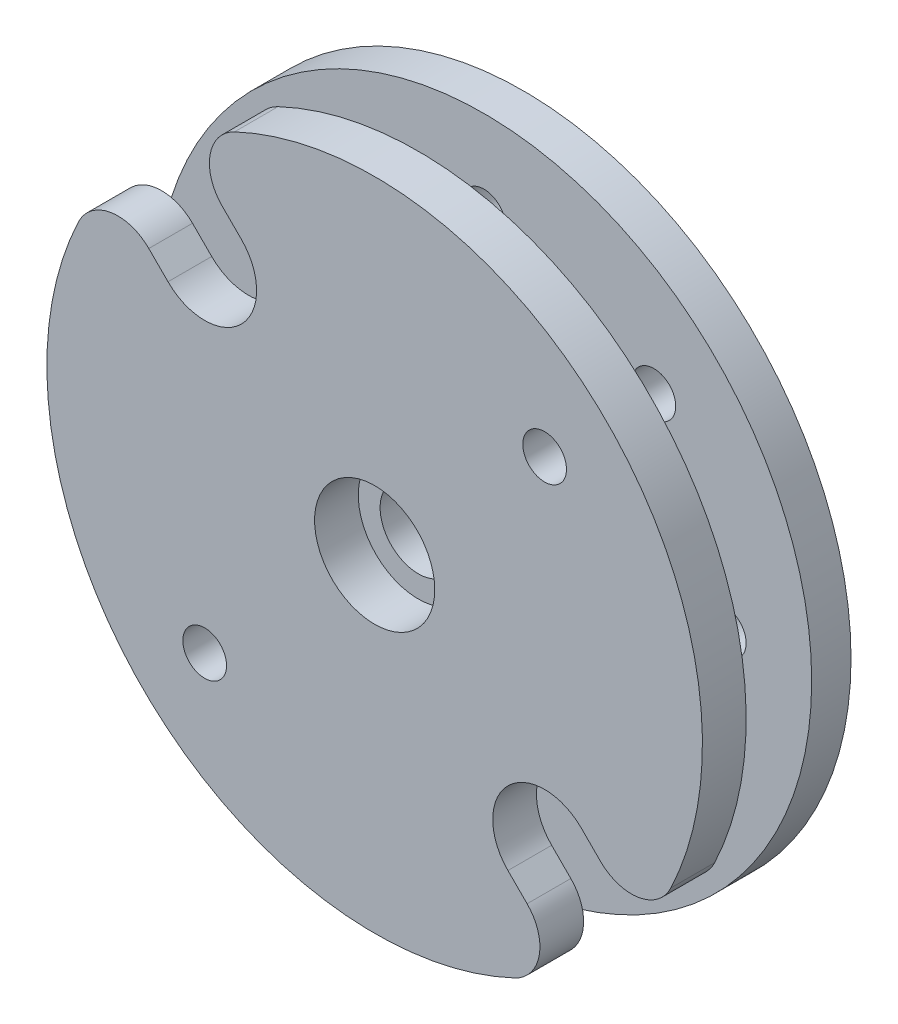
ISO-10303-21;
HEADER;
FILE_DESCRIPTION(('STEP AP214'),'2;1');
FILE_NAME('part.step','',(''),(''),'','','');
FILE_SCHEMA(('AUTOMOTIVE_DESIGN { 1 0 10303 214 1 1 1 1 }'));
ENDSEC;
DATA;
#1=APPLICATION_CONTEXT('core data for automotive mechanical design processes');
#2=APPLICATION_PROTOCOL_DEFINITION('international standard','automotive_design',2000,#1);
#3=PRODUCT_CONTEXT('',#1,'mechanical');
#4=PRODUCT('Part','Part','',(#3));
#5=PRODUCT_RELATED_PRODUCT_CATEGORY('part','',(#4));
#6=PRODUCT_DEFINITION_FORMATION('','',#4);
#7=PRODUCT_DEFINITION_CONTEXT('part definition',#1,'design');
#8=PRODUCT_DEFINITION('design','',#6,#7);
#9=PRODUCT_DEFINITION_SHAPE('','',#8);
#10=(LENGTH_UNIT() NAMED_UNIT(*) SI_UNIT(.MILLI.,.METRE.));
#11=(NAMED_UNIT(*) PLANE_ANGLE_UNIT() SI_UNIT($,.RADIAN.));
#12=(NAMED_UNIT(*) SI_UNIT($,.STERADIAN.) SOLID_ANGLE_UNIT());
#13=UNCERTAINTY_MEASURE_WITH_UNIT(LENGTH_MEASURE(1.E-05),#10,'distance_accuracy_value','');
#14=(GEOMETRIC_REPRESENTATION_CONTEXT(3) GLOBAL_UNCERTAINTY_ASSIGNED_CONTEXT((#13)) GLOBAL_UNIT_ASSIGNED_CONTEXT((#10,
#11,#12)) REPRESENTATION_CONTEXT('',''));
#15=CARTESIAN_POINT('',(0.,0.,0.));
#16=DIRECTION('',(0.,0.,1.));
#17=DIRECTION('',(1.,0.,0.));
#18=AXIS2_PLACEMENT_3D('',#15,#16,#17);
#19=CARTESIAN_POINT('',(0.,0.,-39.4264068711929));
#20=DIRECTION('',(0.,0.,1.));
#21=DIRECTION('',(1.,0.,0.));
#22=AXIS2_PLACEMENT_3D('',#19,#20,#21);
#23=CYLINDRICAL_SURFACE('',#22,15.);
#24=CARTESIAN_POINT('',(0.,0.,5.));
#25=DIRECTION('',(0.,0.,1.));
#26=DIRECTION('',(1.,0.,0.));
#27=AXIS2_PLACEMENT_3D('',#24,#25,#26);
#28=CIRCLE('',#27,15.);
#29=CARTESIAN_POINT('',(13.5574451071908,-6.41838625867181,5.));
#30=VERTEX_POINT('',#29);
#31=CARTESIAN_POINT('',(-6.41838625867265,13.5574451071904,5.));
#32=VERTEX_POINT('',#31);
#33=EDGE_CURVE('E222',#30,#32,#28,.T.);
#34=ORIENTED_EDGE('',*,*,#33,.F.);
#35=DIRECTION('',(0.,0.,1.));
#36=VECTOR('',#35,1.);
#37=CARTESIAN_POINT('',(13.5574451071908,-6.4183862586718,-39.4264068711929));
#38=LINE('',#37,#36);
#39=CARTESIAN_POINT('',(13.5574451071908,-6.41838625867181,3.));
#40=VERTEX_POINT('',#39);
#41=EDGE_CURVE('E345',#30,#40,#38,.F.);
#42=ORIENTED_EDGE('',*,*,#41,.T.);
#43=CARTESIAN_POINT('',(0.,0.,3.));
#44=DIRECTION('',(0.,0.,1.));
#45=DIRECTION('',(1.,0.,0.));
#46=AXIS2_PLACEMENT_3D('',#43,#44,#45);
#47=CIRCLE('',#46,15.);
#48=CARTESIAN_POINT('',(-6.41838625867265,13.5574451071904,3.));
#49=VERTEX_POINT('',#48);
#50=EDGE_CURVE('E226',#49,#40,#47,.F.);
#51=ORIENTED_EDGE('',*,*,#50,.F.);
#52=DIRECTION('',(0.,0.,1.));
#53=VECTOR('',#52,1.);
#54=CARTESIAN_POINT('',(-6.41838625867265,13.5574451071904,-39.4264068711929));
#55=LINE('',#54,#53);
#56=EDGE_CURVE('E341',#49,#32,#55,.T.);
#57=ORIENTED_EDGE('',*,*,#56,.T.);
#58=EDGE_LOOP('',(#34,#42,#51,#57));
#59=FACE_BOUND('',#58,.T.);
#60=ADVANCED_FACE('F38',(#59),#23,.T.);
#61=CARTESIAN_POINT('',(0.,0.,0.));
#62=DIRECTION('',(0.,0.,1.));
#63=DIRECTION('',(1.,0.,0.));
#64=AXIS2_PLACEMENT_3D('',#61,#62,#63);
#65=PLANE('',#64);
#66=CARTESIAN_POINT('',(0.,0.,0.));
#67=DIRECTION('',(0.,0.,1.));
#68=DIRECTION('',(1.,0.,0.));
#69=AXIS2_PLACEMENT_3D('',#66,#67,#68);
#70=CIRCLE('',#69,7.);
#71=CARTESIAN_POINT('',(7.,0.,0.));
#72=VERTEX_POINT('',#71);
#73=EDGE_CURVE('E11',#72,#72,#70,.F.);
#74=ORIENTED_EDGE('',*,*,#73,.T.);
#75=EDGE_LOOP('',(#74));
#76=FACE_BOUND('',#75,.T.);
#77=CARTESIAN_POINT('',(-7.77817459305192,7.77817459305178,0.));
#78=DIRECTION('',(0.,0.,1.));
#79=DIRECTION('',(1.,0.,0.));
#80=AXIS2_PLACEMENT_3D('',#77,#78,#79);
#81=CIRCLE('',#80,2.375);
#82=CARTESIAN_POINT('',(-5.40317459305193,7.77817459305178,0.));
#83=VERTEX_POINT('',#82);
#84=EDGE_CURVE('E235',#83,#83,#81,.T.);
#85=ORIENTED_EDGE('',*,*,#84,.F.);
#86=EDGE_LOOP('',(#85));
#87=FACE_BOUND('',#86,.T.);
#88=CARTESIAN_POINT('',(7.7781745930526,-7.77817459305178,0.));
#89=DIRECTION('',(0.,0.,1.));
#90=DIRECTION('',(1.,0.,0.));
#91=AXIS2_PLACEMENT_3D('',#88,#89,#90);
#92=CIRCLE('',#91,2.375);
#93=CARTESIAN_POINT('',(10.1531745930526,-7.77817459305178,0.));
#94=VERTEX_POINT('',#93);
#95=EDGE_CURVE('E234',#94,#94,#92,.T.);
#96=ORIENTED_EDGE('',*,*,#95,.F.);
#97=EDGE_LOOP('',(#96));
#98=FACE_BOUND('',#97,.T.);
#99=CARTESIAN_POINT('',(0.,0.,0.));
#100=DIRECTION('',(0.,0.,1.));
#101=DIRECTION('',(1.,0.,0.));
#102=AXIS2_PLACEMENT_3D('',#99,#100,#101);
#103=CIRCLE('',#102,15.);
#104=CARTESIAN_POINT('',(15.,0.,0.));
#105=VERTEX_POINT('',#104);
#106=EDGE_CURVE('E314',#105,#105,#103,.T.);
#107=ORIENTED_EDGE('',*,*,#106,.T.);
#108=EDGE_LOOP('',(#107));
#109=FACE_BOUND('',#108,.T.);
#110=CARTESIAN_POINT('',(0.,11.,0.));
#111=DIRECTION('',(0.,0.,1.));
#112=DIRECTION('',(1.,0.,0.));
#113=AXIS2_PLACEMENT_3D('',#110,#111,#112);
#114=CIRCLE('',#113,1.);
#115=CARTESIAN_POINT('',(1.,11.,0.));
#116=VERTEX_POINT('',#115);
#117=EDGE_CURVE('E299',#116,#116,#114,.T.);
#118=ORIENTED_EDGE('',*,*,#117,.F.);
#119=EDGE_LOOP('',(#118));
#120=FACE_BOUND('',#119,.T.);
#121=CARTESIAN_POINT('',(7.77817459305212,7.77817459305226,0.));
#122=DIRECTION('',(0.,0.,1.));
#123=DIRECTION('',(1.,0.,0.));
#124=AXIS2_PLACEMENT_3D('',#121,#122,#123);
#125=CIRCLE('',#124,1.);
#126=CARTESIAN_POINT('',(8.77817459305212,7.77817459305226,0.));
#127=VERTEX_POINT('',#126);
#128=EDGE_CURVE('E291',#127,#127,#125,.T.);
#129=ORIENTED_EDGE('',*,*,#128,.F.);
#130=EDGE_LOOP('',(#129));
#131=FACE_BOUND('',#130,.T.);
#132=CARTESIAN_POINT('',(11.0000000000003,3.40264492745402E-13,0.));
#133=DIRECTION('',(0.,0.,1.));
#134=DIRECTION('',(1.,0.,0.));
#135=AXIS2_PLACEMENT_3D('',#132,#133,#134);
#136=CIRCLE('',#135,1.);
#137=CARTESIAN_POINT('',(12.0000000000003,3.40264492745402E-13,0.));
#138=VERTEX_POINT('',#137);
#139=EDGE_CURVE('E283',#138,#138,#136,.T.);
#140=ORIENTED_EDGE('',*,*,#139,.F.);
#141=EDGE_LOOP('',(#140));
#142=FACE_BOUND('',#141,.T.);
#143=CARTESIAN_POINT('',(6.80528985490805E-13,-11.,0.));
#144=DIRECTION('',(0.,0.,1.));
#145=DIRECTION('',(1.,0.,0.));
#146=AXIS2_PLACEMENT_3D('',#143,#144,#145);
#147=CIRCLE('',#146,1.);
#148=CARTESIAN_POINT('',(1.00000000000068,-11.,0.));
#149=VERTEX_POINT('',#148);
#150=EDGE_CURVE('E275',#149,#149,#147,.T.);
#151=ORIENTED_EDGE('',*,*,#150,.F.);
#152=EDGE_LOOP('',(#151));
#153=FACE_BOUND('',#152,.T.);
#154=CARTESIAN_POINT('',(-7.77817459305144,-7.77817459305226,0.));
#155=DIRECTION('',(0.,0.,1.));
#156=DIRECTION('',(1.,0.,0.));
#157=AXIS2_PLACEMENT_3D('',#154,#155,#156);
#158=CIRCLE('',#157,1.);
#159=CARTESIAN_POINT('',(-6.77817459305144,-7.77817459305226,0.));
#160=VERTEX_POINT('',#159);
#161=EDGE_CURVE('E267',#160,#160,#158,.T.);
#162=ORIENTED_EDGE('',*,*,#161,.F.);
#163=EDGE_LOOP('',(#162));
#164=FACE_BOUND('',#163,.T.);
#165=CARTESIAN_POINT('',(-10.9999999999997,-3.41611604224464E-13,0.));
#166=DIRECTION('',(0.,0.,1.));
#167=DIRECTION('',(1.,0.,0.));
#168=AXIS2_PLACEMENT_3D('',#165,#166,#167);
#169=CIRCLE('',#168,1.);
#170=CARTESIAN_POINT('',(-9.99999999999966,-3.41611604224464E-13,0.));
#171=VERTEX_POINT('',#170);
#172=EDGE_CURVE('E262',#171,#171,#169,.T.);
#173=ORIENTED_EDGE('',*,*,#172,.F.);
#174=EDGE_LOOP('',(#173));
#175=FACE_BOUND('',#174,.T.);
#176=ADVANCED_FACE('F464',(#76,#87,#98,#109,#120,#131,#142,#153,#164,#175),#65,.T.);
#177=CARTESIAN_POINT('',(0.,0.,-1.8));
#178=DIRECTION('',(0.,0.,1.));
#179=DIRECTION('',(1.,0.,0.));
#180=AXIS2_PLACEMENT_3D('',#177,#178,#179);
#181=CYLINDRICAL_SURFACE('',#180,15.);
#182=CARTESIAN_POINT('',(0.,0.,-1.8));
#183=DIRECTION('',(0.,0.,1.));
#184=DIRECTION('',(1.,0.,0.));
#185=AXIS2_PLACEMENT_3D('',#182,#183,#184);
#186=CIRCLE('',#185,15.);
#187=CARTESIAN_POINT('',(15.,0.,-1.8));
#188=VERTEX_POINT('',#187);
#189=EDGE_CURVE('E315',#188,#188,#186,.T.);
#190=ORIENTED_EDGE('',*,*,#189,.T.);
#191=EDGE_LOOP('',(#190));
#192=FACE_BOUND('',#191,.T.);
#193=ORIENTED_EDGE('',*,*,#106,.F.);
#194=EDGE_LOOP('',(#193));
#195=FACE_BOUND('',#194,.T.);
#196=ADVANCED_FACE('F469',(#192,#195),#181,.T.);
#197=CARTESIAN_POINT('',(0.,0.,-1.8));
#198=DIRECTION('',(0.,0.,1.));
#199=DIRECTION('',(1.,0.,0.));
#200=AXIS2_PLACEMENT_3D('',#197,#198,#199);
#201=PLANE('',#200);
#202=CARTESIAN_POINT('',(-7.77817459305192,7.77817459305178,-1.8));
#203=DIRECTION('',(0.,0.,1.));
#204=DIRECTION('',(1.,0.,0.));
#205=AXIS2_PLACEMENT_3D('',#202,#203,#204);
#206=CIRCLE('',#205,2.375);
#207=CARTESIAN_POINT('',(-5.40317459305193,7.77817459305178,-1.8));
#208=VERTEX_POINT('',#207);
#209=EDGE_CURVE('E230',#208,#208,#206,.T.);
#210=ORIENTED_EDGE('',*,*,#209,.T.);
#211=EDGE_LOOP('',(#210));
#212=FACE_BOUND('',#211,.T.);
#213=CARTESIAN_POINT('',(7.7781745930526,-7.77817459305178,-1.8));
#214=DIRECTION('',(0.,0.,1.));
#215=DIRECTION('',(1.,0.,0.));
#216=AXIS2_PLACEMENT_3D('',#213,#214,#215);
#217=CIRCLE('',#216,2.375);
#218=CARTESIAN_POINT('',(10.1531745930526,-7.77817459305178,-1.8));
#219=VERTEX_POINT('',#218);
#220=EDGE_CURVE('E239',#219,#219,#217,.T.);
#221=ORIENTED_EDGE('',*,*,#220,.T.);
#222=EDGE_LOOP('',(#221));
#223=FACE_BOUND('',#222,.T.);
#224=CARTESIAN_POINT('',(-10.9999999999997,-3.41611604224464E-13,-1.8));
#225=DIRECTION('',(0.,0.,1.));
#226=DIRECTION('',(1.,0.,0.));
#227=AXIS2_PLACEMENT_3D('',#224,#225,#226);
#228=CIRCLE('',#227,1.);
#229=CARTESIAN_POINT('',(-9.99999999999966,-3.41611604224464E-13,-1.8));
#230=VERTEX_POINT('',#229);
#231=EDGE_CURVE('E263',#230,#230,#228,.T.);
#232=ORIENTED_EDGE('',*,*,#231,.T.);
#233=EDGE_LOOP('',(#232));
#234=FACE_BOUND('',#233,.T.);
#235=CARTESIAN_POINT('',(-7.77817459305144,-7.77817459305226,-1.8));
#236=DIRECTION('',(0.,0.,1.));
#237=DIRECTION('',(1.,0.,0.));
#238=AXIS2_PLACEMENT_3D('',#235,#236,#237);
#239=CIRCLE('',#238,1.);
#240=CARTESIAN_POINT('',(-6.77817459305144,-7.77817459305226,-1.8));
#241=VERTEX_POINT('',#240);
#242=EDGE_CURVE('E271',#241,#241,#239,.T.);
#243=ORIENTED_EDGE('',*,*,#242,.T.);
#244=EDGE_LOOP('',(#243));
#245=FACE_BOUND('',#244,.T.);
#246=CARTESIAN_POINT('',(6.80528985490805E-13,-11.,-1.8));
#247=DIRECTION('',(0.,0.,1.));
#248=DIRECTION('',(1.,0.,0.));
#249=AXIS2_PLACEMENT_3D('',#246,#247,#248);
#250=CIRCLE('',#249,1.);
#251=CARTESIAN_POINT('',(1.00000000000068,-11.,-1.8));
#252=VERTEX_POINT('',#251);
#253=EDGE_CURVE('E279',#252,#252,#250,.T.);
#254=ORIENTED_EDGE('',*,*,#253,.T.);
#255=EDGE_LOOP('',(#254));
#256=FACE_BOUND('',#255,.T.);
#257=CARTESIAN_POINT('',(11.0000000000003,3.40264492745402E-13,-1.8));
#258=DIRECTION('',(0.,0.,1.));
#259=DIRECTION('',(1.,0.,0.));
#260=AXIS2_PLACEMENT_3D('',#257,#258,#259);
#261=CIRCLE('',#260,1.);
#262=CARTESIAN_POINT('',(12.0000000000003,3.40264492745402E-13,-1.8));
#263=VERTEX_POINT('',#262);
#264=EDGE_CURVE('E287',#263,#263,#261,.T.);
#265=ORIENTED_EDGE('',*,*,#264,.T.);
#266=EDGE_LOOP('',(#265));
#267=FACE_BOUND('',#266,.T.);
#268=CARTESIAN_POINT('',(7.77817459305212,7.77817459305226,-1.8));
#269=DIRECTION('',(0.,0.,1.));
#270=DIRECTION('',(1.,0.,0.));
#271=AXIS2_PLACEMENT_3D('',#268,#269,#270);
#272=CIRCLE('',#271,1.);
#273=CARTESIAN_POINT('',(8.77817459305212,7.77817459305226,-1.8));
#274=VERTEX_POINT('',#273);
#275=EDGE_CURVE('E295',#274,#274,#272,.T.);
#276=ORIENTED_EDGE('',*,*,#275,.T.);
#277=EDGE_LOOP('',(#276));
#278=FACE_BOUND('',#277,.T.);
#279=CARTESIAN_POINT('',(0.,11.,-1.8));
#280=DIRECTION('',(0.,0.,1.));
#281=DIRECTION('',(1.,0.,0.));
#282=AXIS2_PLACEMENT_3D('',#279,#280,#281);
#283=CIRCLE('',#282,1.);
#284=CARTESIAN_POINT('',(1.,11.,-1.8));
#285=VERTEX_POINT('',#284);
#286=EDGE_CURVE('E303',#285,#285,#283,.T.);
#287=ORIENTED_EDGE('',*,*,#286,.T.);
#288=EDGE_LOOP('',(#287));
#289=FACE_BOUND('',#288,.T.);
#290=CARTESIAN_POINT('',(0.,0.,-1.8));
#291=DIRECTION('',(0.,0.,1.));
#292=DIRECTION('',(1.,0.,0.));
#293=AXIS2_PLACEMENT_3D('',#290,#291,#292);
#294=CIRCLE('',#293,5.25);
#295=CARTESIAN_POINT('',(5.25,0.,-1.8));
#296=VERTEX_POINT('',#295);
#297=EDGE_CURVE('E307',#296,#296,#294,.T.);
#298=ORIENTED_EDGE('',*,*,#297,.T.);
#299=EDGE_LOOP('',(#298));
#300=FACE_BOUND('',#299,.T.);
#301=ORIENTED_EDGE('',*,*,#189,.F.);
#302=EDGE_LOOP('',(#301));
#303=FACE_BOUND('',#302,.T.);
#304=ADVANCED_FACE('F537',(#212,#223,#234,#245,#256,#267,#278,#289,#300,#303),#201,.F.);
#305=CARTESIAN_POINT('',(0.,0.,-1.8));
#306=DIRECTION('',(0.,0.,1.));
#307=DIRECTION('',(1.,0.,0.));
#308=AXIS2_PLACEMENT_3D('',#305,#306,#307);
#309=CYLINDRICAL_SURFACE('',#308,5.25);
#310=ORIENTED_EDGE('',*,*,#297,.F.);
#311=EDGE_LOOP('',(#310));
#312=FACE_BOUND('',#311,.T.);
#313=CARTESIAN_POINT('',(0.,0.,0.));
#314=DIRECTION('',(0.,0.,1.));
#315=DIRECTION('',(1.,0.,0.));
#316=AXIS2_PLACEMENT_3D('',#313,#314,#315);
#317=CIRCLE('',#316,5.25);
#318=CARTESIAN_POINT('',(5.25,0.,0.));
#319=VERTEX_POINT('',#318);
#320=EDGE_CURVE('E255',#319,#319,#317,.F.);
#321=ORIENTED_EDGE('',*,*,#320,.F.);
#322=EDGE_LOOP('',(#321));
#323=FACE_BOUND('',#322,.T.);
#324=ADVANCED_FACE('F533',(#312,#323),#309,.F.);
#325=CARTESIAN_POINT('',(0.,11.,-1.8));
#326=DIRECTION('',(0.,0.,1.));
#327=DIRECTION('',(1.,0.,0.));
#328=AXIS2_PLACEMENT_3D('',#325,#326,#327);
#329=CYLINDRICAL_SURFACE('',#328,1.);
#330=ORIENTED_EDGE('',*,*,#286,.F.);
#331=EDGE_LOOP('',(#330));
#332=FACE_BOUND('',#331,.T.);
#333=ORIENTED_EDGE('',*,*,#117,.T.);
#334=EDGE_LOOP('',(#333));
#335=FACE_BOUND('',#334,.T.);
#336=ADVANCED_FACE('F529',(#332,#335),#329,.F.);
#337=CARTESIAN_POINT('',(7.77817459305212,7.77817459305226,-1.8));
#338=DIRECTION('',(0.,0.,1.));
#339=DIRECTION('',(1.,0.,0.));
#340=AXIS2_PLACEMENT_3D('',#337,#338,#339);
#341=CYLINDRICAL_SURFACE('',#340,1.);
#342=ORIENTED_EDGE('',*,*,#275,.F.);
#343=EDGE_LOOP('',(#342));
#344=FACE_BOUND('',#343,.T.);
#345=ORIENTED_EDGE('',*,*,#128,.T.);
#346=EDGE_LOOP('',(#345));
#347=FACE_BOUND('',#346,.T.);
#348=ADVANCED_FACE('F525',(#344,#347),#341,.F.);
#349=CARTESIAN_POINT('',(11.0000000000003,3.40264492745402E-13,-1.8));
#350=DIRECTION('',(0.,0.,1.));
#351=DIRECTION('',(1.,0.,0.));
#352=AXIS2_PLACEMENT_3D('',#349,#350,#351);
#353=CYLINDRICAL_SURFACE('',#352,1.);
#354=ORIENTED_EDGE('',*,*,#264,.F.);
#355=EDGE_LOOP('',(#354));
#356=FACE_BOUND('',#355,.T.);
#357=ORIENTED_EDGE('',*,*,#139,.T.);
#358=EDGE_LOOP('',(#357));
#359=FACE_BOUND('',#358,.T.);
#360=ADVANCED_FACE('F521',(#356,#359),#353,.F.);
#361=CARTESIAN_POINT('',(6.80528985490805E-13,-11.,-1.8));
#362=DIRECTION('',(0.,0.,1.));
#363=DIRECTION('',(1.,0.,0.));
#364=AXIS2_PLACEMENT_3D('',#361,#362,#363);
#365=CYLINDRICAL_SURFACE('',#364,1.);
#366=ORIENTED_EDGE('',*,*,#253,.F.);
#367=EDGE_LOOP('',(#366));
#368=FACE_BOUND('',#367,.T.);
#369=ORIENTED_EDGE('',*,*,#150,.T.);
#370=EDGE_LOOP('',(#369));
#371=FACE_BOUND('',#370,.T.);
#372=ADVANCED_FACE('F517',(#368,#371),#365,.F.);
#373=CARTESIAN_POINT('',(-7.77817459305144,-7.77817459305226,-1.8));
#374=DIRECTION('',(0.,0.,1.));
#375=DIRECTION('',(1.,0.,0.));
#376=AXIS2_PLACEMENT_3D('',#373,#374,#375);
#377=CYLINDRICAL_SURFACE('',#376,1.);
#378=ORIENTED_EDGE('',*,*,#242,.F.);
#379=EDGE_LOOP('',(#378));
#380=FACE_BOUND('',#379,.T.);
#381=ORIENTED_EDGE('',*,*,#161,.T.);
#382=EDGE_LOOP('',(#381));
#383=FACE_BOUND('',#382,.T.);
#384=ADVANCED_FACE('F513',(#380,#383),#377,.F.);
#385=CARTESIAN_POINT('',(-10.9999999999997,-3.41611604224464E-13,-1.8));
#386=DIRECTION('',(0.,0.,1.));
#387=DIRECTION('',(1.,0.,0.));
#388=AXIS2_PLACEMENT_3D('',#385,#386,#387);
#389=CYLINDRICAL_SURFACE('',#388,1.);
#390=ORIENTED_EDGE('',*,*,#231,.F.);
#391=EDGE_LOOP('',(#390));
#392=FACE_BOUND('',#391,.T.);
#393=ORIENTED_EDGE('',*,*,#172,.T.);
#394=EDGE_LOOP('',(#393));
#395=FACE_BOUND('',#394,.T.);
#396=ADVANCED_FACE('F507',(#392,#395),#389,.F.);
#397=CARTESIAN_POINT('',(0.,0.,0.));
#398=DIRECTION('',(0.,0.,1.));
#399=DIRECTION('',(1.,0.,0.));
#400=AXIS2_PLACEMENT_3D('',#397,#398,#399);
#401=PLANE('',#400);
#402=CARTESIAN_POINT('',(0.,0.,0.));
#403=DIRECTION('',(0.,0.,1.));
#404=DIRECTION('',(1.,0.,0.));
#405=AXIS2_PLACEMENT_3D('',#402,#403,#404);
#406=CIRCLE('',#405,1.75);
#407=CARTESIAN_POINT('',(1.75,0.,0.));
#408=VERTEX_POINT('',#407);
#409=EDGE_CURVE('E250',#408,#408,#406,.T.);
#410=ORIENTED_EDGE('',*,*,#409,.T.);
#411=EDGE_LOOP('',(#410));
#412=FACE_BOUND('',#411,.T.);
#413=ORIENTED_EDGE('',*,*,#320,.T.);
#414=EDGE_LOOP('',(#413));
#415=FACE_BOUND('',#414,.T.);
#416=ADVANCED_FACE('F503',(#412,#415),#401,.F.);
#417=CARTESIAN_POINT('',(0.,0.,3.));
#418=DIRECTION('',(0.,0.,1.));
#419=DIRECTION('',(1.,0.,0.));
#420=AXIS2_PLACEMENT_3D('',#417,#418,#419);
#421=PLANE('',#420);
#422=CARTESIAN_POINT('',(0.,0.,3.));
#423=DIRECTION('',(0.,0.,1.));
#424=DIRECTION('',(1.,0.,0.));
#425=AXIS2_PLACEMENT_3D('',#422,#423,#424);
#426=CIRCLE('',#425,2.75);
#427=CARTESIAN_POINT('',(2.75,0.,3.));
#428=VERTEX_POINT('',#427);
#429=EDGE_CURVE('E319',#428,#428,#426,.F.);
#430=ORIENTED_EDGE('',*,*,#429,.F.);
#431=EDGE_LOOP('',(#430));
#432=FACE_BOUND('',#431,.T.);
#433=CARTESIAN_POINT('',(0.,0.,3.));
#434=DIRECTION('',(0.,0.,1.));
#435=DIRECTION('',(1.,0.,0.));
#436=AXIS2_PLACEMENT_3D('',#433,#434,#435);
#437=CIRCLE('',#436,1.75);
#438=CARTESIAN_POINT('',(1.75,0.,3.));
#439=VERTEX_POINT('',#438);
#440=EDGE_CURVE('E251',#439,#439,#437,.T.);
#441=ORIENTED_EDGE('',*,*,#440,.F.);
#442=EDGE_LOOP('',(#441));
#443=FACE_BOUND('',#442,.T.);
#444=ADVANCED_FACE('F500',(#432,#443),#421,.T.);
#445=CARTESIAN_POINT('',(0.,0.,3.));
#446=DIRECTION('',(0.,0.,-1.));
#447=DIRECTION('',(-1.,0.,0.));
#448=AXIS2_PLACEMENT_3D('',#445,#446,#447);
#449=CYLINDRICAL_SURFACE('',#448,6.25);
#450=CARTESIAN_POINT('',(0.,0.,2.25));
#451=DIRECTION('',(0.,0.,1.));
#452=DIRECTION('',(1.,0.,0.));
#453=AXIS2_PLACEMENT_3D('',#450,#451,#452);
#454=CIRCLE('',#453,6.25);
#455=CARTESIAN_POINT('',(6.25,0.,2.25));
#456=VERTEX_POINT('',#455);
#457=EDGE_CURVE('E47',#456,#456,#454,.F.);
#458=ORIENTED_EDGE('',*,*,#457,.T.);
#459=EDGE_LOOP('',(#458));
#460=FACE_BOUND('',#459,.T.);
#461=CARTESIAN_POINT('',(0.,0.,0.750000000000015));
#462=DIRECTION('',(0.,0.,1.));
#463=DIRECTION('',(1.,0.,0.));
#464=AXIS2_PLACEMENT_3D('',#461,#462,#463);
#465=CIRCLE('',#464,6.25);
#466=CARTESIAN_POINT('',(6.25,0.,0.750000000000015));
#467=VERTEX_POINT('',#466);
#468=EDGE_CURVE('E378',#467,#467,#465,.T.);
#469=ORIENTED_EDGE('',*,*,#468,.T.);
#470=EDGE_LOOP('',(#469));
#471=FACE_BOUND('',#470,.T.);
#472=ADVANCED_FACE('F385',(#460,#471),#449,.T.);
#473=CARTESIAN_POINT('',(0.,0.,3.));
#474=DIRECTION('',(0.,0.,-1.));
#475=DIRECTION('',(-1.,0.,0.));
#476=AXIS2_PLACEMENT_3D('',#473,#474,#475);
#477=CYLINDRICAL_SURFACE('',#476,1.75);
#478=ORIENTED_EDGE('',*,*,#440,.T.);
#479=EDGE_LOOP('',(#478));
#480=FACE_BOUND('',#479,.T.);
#481=ORIENTED_EDGE('',*,*,#409,.F.);
#482=EDGE_LOOP('',(#481));
#483=FACE_BOUND('',#482,.T.);
#484=ADVANCED_FACE('F397',(#480,#483),#477,.F.);
#485=CARTESIAN_POINT('',(0.,0.,3.));
#486=DIRECTION('',(0.,0.,1.));
#487=DIRECTION('',(1.,0.,0.));
#488=AXIS2_PLACEMENT_3D('',#485,#486,#487);
#489=PLANE('',#488);
#490=CARTESIAN_POINT('',(0.,0.,3.));
#491=DIRECTION('',(0.,0.,1.));
#492=DIRECTION('',(1.,0.,0.));
#493=AXIS2_PLACEMENT_3D('',#490,#491,#492);
#494=CIRCLE('',#493,7.00000000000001);
#495=CARTESIAN_POINT('',(7.00000000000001,0.,3.));
#496=VERTEX_POINT('',#495);
#497=EDGE_CURVE('E374',#496,#496,#494,.T.);
#498=ORIENTED_EDGE('',*,*,#497,.T.);
#499=EDGE_LOOP('',(#498));
#500=FACE_BOUND('',#499,.T.);
#501=CARTESIAN_POINT('',(-7.77817459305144,-7.77817459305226,3.));
#502=DIRECTION('',(0.,0.,1.));
#503=DIRECTION('',(1.,0.,0.));
#504=AXIS2_PLACEMENT_3D('',#501,#502,#503);
#505=CIRCLE('',#504,1.);
#506=CARTESIAN_POINT('',(-6.77817459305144,-7.77817459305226,3.));
#507=VERTEX_POINT('',#506);
#508=EDGE_CURVE('E402',#507,#507,#505,.T.);
#509=ORIENTED_EDGE('',*,*,#508,.T.);
#510=EDGE_LOOP('',(#509));
#511=FACE_BOUND('',#510,.T.);
#512=CARTESIAN_POINT('',(7.77817459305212,7.77817459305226,3.));
#513=DIRECTION('',(0.,0.,1.));
#514=DIRECTION('',(1.,0.,0.));
#515=AXIS2_PLACEMENT_3D('',#512,#513,#514);
#516=CIRCLE('',#515,1.);
#517=CARTESIAN_POINT('',(8.77817459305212,7.77817459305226,3.));
#518=VERTEX_POINT('',#517);
#519=EDGE_CURVE('E177',#518,#518,#516,.T.);
#520=ORIENTED_EDGE('',*,*,#519,.T.);
#521=EDGE_LOOP('',(#520));
#522=FACE_BOUND('',#521,.T.);
#523=ORIENTED_EDGE('',*,*,#50,.T.);
#524=CARTESIAN_POINT('',(11.7497857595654,-5.56260142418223,3.));
#525=DIRECTION('',(0.,0.,1.));
#526=DIRECTION('',(1.,0.,0.));
#527=AXIS2_PLACEMENT_3D('',#524,#525,#526);
#528=CIRCLE('',#527,2.);
#529=CARTESIAN_POINT('',(10.3355721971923,-6.97681498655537,3.));
#530=VERTEX_POINT('',#529);
#531=EDGE_CURVE('E356',#40,#530,#528,.F.);
#532=ORIENTED_EDGE('',*,*,#531,.T.);
#533=DIRECTION('',(0.707106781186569,-0.707106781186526,0.));
#534=VECTOR('',#533,1.);
#535=CARTESIAN_POINT('',(9.4575531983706,-6.09879598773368,3.));
#536=LINE('',#535,#534);
#537=CARTESIAN_POINT('',(9.4575531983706,-6.09879598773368,3.));
#538=VERTEX_POINT('',#537);
#539=EDGE_CURVE('E191',#538,#530,#536,.T.);
#540=ORIENTED_EDGE('',*,*,#539,.F.);
#541=CARTESIAN_POINT('',(7.7781745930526,-7.77817459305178,3.));
#542=DIRECTION('',(0.,0.,1.));
#543=DIRECTION('',(1.,0.,0.));
#544=AXIS2_PLACEMENT_3D('',#541,#542,#543);
#545=CIRCLE('',#544,2.375);
#546=CARTESIAN_POINT('',(6.0987959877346,-9.45755319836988,3.));
#547=VERTEX_POINT('',#546);
#548=EDGE_CURVE('E196',#547,#538,#545,.F.);
#549=ORIENTED_EDGE('',*,*,#548,.F.);
#550=DIRECTION('',(-0.70710678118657,0.707106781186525,0.));
#551=VECTOR('',#550,1.);
#552=CARTESIAN_POINT('',(6.0987959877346,-9.45755319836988,3.));
#553=LINE('',#552,#551);
#554=CARTESIAN_POINT('',(6.97681498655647,-10.3355721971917,3.));
#555=VERTEX_POINT('',#554);
#556=EDGE_CURVE('E162',#555,#547,#553,.T.);
#557=ORIENTED_EDGE('',*,*,#556,.F.);
#558=CARTESIAN_POINT('',(5.56260142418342,-11.7497857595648,3.));
#559=DIRECTION('',(0.,0.,1.));
#560=DIRECTION('',(1.,0.,0.));
#561=AXIS2_PLACEMENT_3D('',#558,#559,#560);
#562=CIRCLE('',#561,2.);
#563=CARTESIAN_POINT('',(6.41838625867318,-13.5574451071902,3.));
#564=VERTEX_POINT('',#563);
#565=EDGE_CURVE('E353',#555,#564,#562,.F.);
#566=ORIENTED_EDGE('',*,*,#565,.T.);
#567=CARTESIAN_POINT('',(-13.5574451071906,6.41838625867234,3.));
#568=VERTEX_POINT('',#567);
#569=EDGE_CURVE('E223',#564,#568,#47,.F.);
#570=ORIENTED_EDGE('',*,*,#569,.T.);
#571=CARTESIAN_POINT('',(-11.7497857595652,5.56260142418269,3.));
#572=DIRECTION('',(0.,0.,1.));
#573=DIRECTION('',(1.,0.,0.));
#574=AXIS2_PLACEMENT_3D('',#571,#572,#573);
#575=CIRCLE('',#574,2.);
#576=CARTESIAN_POINT('',(-10.3355721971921,6.97681498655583,3.));
#577=VERTEX_POINT('',#576);
#578=EDGE_CURVE('E68',#568,#577,#575,.F.);
#579=ORIENTED_EDGE('',*,*,#578,.T.);
#580=DIRECTION('',(-0.70710678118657,0.707106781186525,0.));
#581=VECTOR('',#580,1.);
#582=CARTESIAN_POINT('',(-9.45755319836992,6.09879598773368,3.));
#583=LINE('',#582,#581);
#584=CARTESIAN_POINT('',(-9.45755319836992,6.09879598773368,3.));
#585=VERTEX_POINT('',#584);
#586=EDGE_CURVE('E197',#585,#577,#583,.T.);
#587=ORIENTED_EDGE('',*,*,#586,.F.);
#588=CARTESIAN_POINT('',(-7.77817459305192,7.77817459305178,3.));
#589=DIRECTION('',(0.,0.,1.));
#590=DIRECTION('',(1.,0.,0.));
#591=AXIS2_PLACEMENT_3D('',#588,#589,#590);
#592=CIRCLE('',#591,2.375);
#593=CARTESIAN_POINT('',(-6.09879598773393,9.45755319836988,3.));
#594=VERTEX_POINT('',#593);
#595=EDGE_CURVE('E200',#594,#585,#592,.F.);
#596=ORIENTED_EDGE('',*,*,#595,.F.);
#597=DIRECTION('',(0.707106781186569,-0.707106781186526,0.));
#598=VECTOR('',#597,1.);
#599=CARTESIAN_POINT('',(-6.09879598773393,9.45755319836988,3.));
#600=LINE('',#599,#598);
#601=CARTESIAN_POINT('',(-6.97681498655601,10.3355721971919,3.));
#602=VERTEX_POINT('',#601);
#603=EDGE_CURVE('E204',#602,#594,#600,.T.);
#604=ORIENTED_EDGE('',*,*,#603,.F.);
#605=CARTESIAN_POINT('',(-5.56260142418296,11.7497857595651,3.));
#606=DIRECTION('',(0.,0.,1.));
#607=DIRECTION('',(1.,0.,0.));
#608=AXIS2_PLACEMENT_3D('',#605,#606,#607);
#609=CIRCLE('',#608,2.);
#610=EDGE_CURVE('E348',#602,#49,#609,.F.);
#611=ORIENTED_EDGE('',*,*,#610,.T.);
#612=EDGE_LOOP('',(#523,#532,#540,#549,#557,#566,#570,#579,#587,#596,#604,#611));
#613=FACE_BOUND('',#612,.T.);
#614=ADVANCED_FACE('F394',(#500,#511,#522,#613),#489,.F.);
#615=CARTESIAN_POINT('',(0.,0.,5.));
#616=DIRECTION('',(0.,0.,1.));
#617=DIRECTION('',(1.,0.,0.));
#618=AXIS2_PLACEMENT_3D('',#615,#616,#617);
#619=PLANE('',#618);
#620=CARTESIAN_POINT('',(-7.77817459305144,-7.77817459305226,5.));
#621=DIRECTION('',(0.,0.,-1.));
#622=DIRECTION('',(-1.,0.,0.));
#623=AXIS2_PLACEMENT_3D('',#620,#621,#622);
#624=CIRCLE('',#623,1.);
#625=CARTESIAN_POINT('',(-8.77817459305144,-7.77817459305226,5.));
#626=VERTEX_POINT('',#625);
#627=EDGE_CURVE('E797',#626,#626,#624,.T.);
#628=ORIENTED_EDGE('',*,*,#627,.T.);
#629=EDGE_LOOP('',(#628));
#630=FACE_BOUND('',#629,.T.);
#631=CARTESIAN_POINT('',(7.77817459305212,7.77817459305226,5.));
#632=DIRECTION('',(0.,0.,-1.));
#633=DIRECTION('',(-1.,0.,0.));
#634=AXIS2_PLACEMENT_3D('',#631,#632,#633);
#635=CIRCLE('',#634,1.);
#636=CARTESIAN_POINT('',(6.77817459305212,7.77817459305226,5.));
#637=VERTEX_POINT('',#636);
#638=EDGE_CURVE('E424',#637,#637,#635,.T.);
#639=ORIENTED_EDGE('',*,*,#638,.T.);
#640=EDGE_LOOP('',(#639));
#641=FACE_BOUND('',#640,.T.);
#642=DIRECTION('',(-0.707106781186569,0.707106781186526,0.));
#643=VECTOR('',#642,1.);
#644=CARTESIAN_POINT('',(9.4575531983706,-6.09879598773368,5.));
#645=LINE('',#644,#643);
#646=CARTESIAN_POINT('',(10.3355721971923,-6.97681498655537,5.));
#647=VERTEX_POINT('',#646);
#648=CARTESIAN_POINT('',(9.4575531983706,-6.09879598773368,5.));
#649=VERTEX_POINT('',#648);
#650=EDGE_CURVE('E167',#647,#649,#645,.T.);
#651=ORIENTED_EDGE('',*,*,#650,.F.);
#652=CARTESIAN_POINT('',(11.7497857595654,-5.56260142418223,5.));
#653=DIRECTION('',(0.,0.,1.));
#654=DIRECTION('',(1.,0.,0.));
#655=AXIS2_PLACEMENT_3D('',#652,#653,#654);
#656=CIRCLE('',#655,2.);
#657=EDGE_CURVE('E338',#647,#30,#656,.T.);
#658=ORIENTED_EDGE('',*,*,#657,.T.);
#659=ORIENTED_EDGE('',*,*,#33,.T.);
#660=CARTESIAN_POINT('',(-5.56260142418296,11.7497857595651,5.));
#661=DIRECTION('',(0.,0.,1.));
#662=DIRECTION('',(1.,0.,0.));
#663=AXIS2_PLACEMENT_3D('',#660,#661,#662);
#664=CIRCLE('',#663,2.);
#665=CARTESIAN_POINT('',(-6.97681498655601,10.3355721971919,5.));
#666=VERTEX_POINT('',#665);
#667=EDGE_CURVE('E330',#32,#666,#664,.T.);
#668=ORIENTED_EDGE('',*,*,#667,.T.);
#669=DIRECTION('',(-0.707106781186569,0.707106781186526,0.));
#670=VECTOR('',#669,1.);
#671=CARTESIAN_POINT('',(-6.09879598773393,9.45755319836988,5.));
#672=LINE('',#671,#670);
#673=CARTESIAN_POINT('',(-6.09879598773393,9.45755319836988,5.));
#674=VERTEX_POINT('',#673);
#675=EDGE_CURVE('E208',#674,#666,#672,.T.);
#676=ORIENTED_EDGE('',*,*,#675,.F.);
#677=CARTESIAN_POINT('',(-7.77817459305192,7.77817459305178,5.));
#678=DIRECTION('',(0.,0.,1.));
#679=DIRECTION('',(-1.,0.,0.));
#680=AXIS2_PLACEMENT_3D('',#677,#678,#679);
#681=CIRCLE('',#680,2.375);
#682=CARTESIAN_POINT('',(-9.45755319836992,6.09879598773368,5.));
#683=VERTEX_POINT('',#682);
#684=EDGE_CURVE('E195',#683,#674,#681,.T.);
#685=ORIENTED_EDGE('',*,*,#684,.F.);
#686=DIRECTION('',(0.70710678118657,-0.707106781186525,0.));
#687=VECTOR('',#686,1.);
#688=CARTESIAN_POINT('',(-9.45755319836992,6.09879598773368,5.));
#689=LINE('',#688,#687);
#690=CARTESIAN_POINT('',(-10.3355721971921,6.97681498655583,5.));
#691=VERTEX_POINT('',#690);
#692=EDGE_CURVE('E211',#691,#683,#689,.T.);
#693=ORIENTED_EDGE('',*,*,#692,.F.);
#694=CARTESIAN_POINT('',(-11.7497857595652,5.56260142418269,5.));
#695=DIRECTION('',(0.,0.,1.));
#696=DIRECTION('',(1.,0.,0.));
#697=AXIS2_PLACEMENT_3D('',#694,#695,#696);
#698=CIRCLE('',#697,2.);
#699=CARTESIAN_POINT('',(-13.5574451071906,6.41838625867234,5.));
#700=VERTEX_POINT('',#699);
#701=EDGE_CURVE('E333',#691,#700,#698,.T.);
#702=ORIENTED_EDGE('',*,*,#701,.T.);
#703=CARTESIAN_POINT('',(6.41838625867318,-13.5574451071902,5.));
#704=VERTEX_POINT('',#703);
#705=EDGE_CURVE('E227',#700,#704,#28,.T.);
#706=ORIENTED_EDGE('',*,*,#705,.T.);
#707=CARTESIAN_POINT('',(5.56260142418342,-11.7497857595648,5.));
#708=DIRECTION('',(0.,0.,1.));
#709=DIRECTION('',(1.,0.,0.));
#710=AXIS2_PLACEMENT_3D('',#707,#708,#709);
#711=CIRCLE('',#710,2.);
#712=CARTESIAN_POINT('',(6.97681498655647,-10.3355721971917,5.));
#713=VERTEX_POINT('',#712);
#714=EDGE_CURVE('E182',#704,#713,#711,.T.);
#715=ORIENTED_EDGE('',*,*,#714,.T.);
#716=DIRECTION('',(0.70710678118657,-0.707106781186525,0.));
#717=VECTOR('',#716,1.);
#718=CARTESIAN_POINT('',(6.0987959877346,-9.45755319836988,5.));
#719=LINE('',#718,#717);
#720=CARTESIAN_POINT('',(6.0987959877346,-9.45755319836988,5.));
#721=VERTEX_POINT('',#720);
#722=EDGE_CURVE('E159',#721,#713,#719,.T.);
#723=ORIENTED_EDGE('',*,*,#722,.F.);
#724=CARTESIAN_POINT('',(7.7781745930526,-7.77817459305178,5.));
#725=DIRECTION('',(0.,0.,1.));
#726=DIRECTION('',(1.,0.,0.));
#727=AXIS2_PLACEMENT_3D('',#724,#725,#726);
#728=CIRCLE('',#727,2.375);
#729=EDGE_CURVE('E171',#649,#721,#728,.T.);
#730=ORIENTED_EDGE('',*,*,#729,.F.);
#731=EDGE_LOOP('',(#651,#658,#659,#668,#676,#685,#693,#702,#706,#715,#723,#730));
#732=FACE_BOUND('',#731,.T.);
#733=CARTESIAN_POINT('',(0.,0.,5.));
#734=DIRECTION('',(0.,0.,1.));
#735=DIRECTION('',(1.,0.,0.));
#736=AXIS2_PLACEMENT_3D('',#733,#734,#735);
#737=CIRCLE('',#736,2.75);
#738=CARTESIAN_POINT('',(2.75,0.,5.));
#739=VERTEX_POINT('',#738);
#740=EDGE_CURVE('E243',#739,#739,#737,.T.);
#741=ORIENTED_EDGE('',*,*,#740,.F.);
#742=EDGE_LOOP('',(#741));
#743=FACE_BOUND('',#742,.T.);
#744=ADVANCED_FACE('F179',(#630,#641,#732,#743),#619,.T.);
#745=CARTESIAN_POINT('',(0.,0.,5.));
#746=DIRECTION('',(0.,0.,-1.));
#747=DIRECTION('',(-1.,0.,0.));
#748=AXIS2_PLACEMENT_3D('',#745,#746,#747);
#749=CYLINDRICAL_SURFACE('',#748,2.75);
#750=ORIENTED_EDGE('',*,*,#740,.T.);
#751=EDGE_LOOP('',(#750));
#752=FACE_BOUND('',#751,.T.);
#753=ORIENTED_EDGE('',*,*,#429,.T.);
#754=EDGE_LOOP('',(#753));
#755=FACE_BOUND('',#754,.T.);
#756=ADVANCED_FACE('F485',(#752,#755),#749,.F.);
#757=CARTESIAN_POINT('',(7.7781745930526,-7.77817459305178,-1.8));
#758=DIRECTION('',(0.,0.,1.));
#759=DIRECTION('',(1.,0.,0.));
#760=AXIS2_PLACEMENT_3D('',#757,#758,#759);
#761=CYLINDRICAL_SURFACE('',#760,2.375);
#762=ORIENTED_EDGE('',*,*,#220,.F.);
#763=EDGE_LOOP('',(#762));
#764=FACE_BOUND('',#763,.T.);
#765=ORIENTED_EDGE('',*,*,#95,.T.);
#766=EDGE_LOOP('',(#765));
#767=FACE_BOUND('',#766,.T.);
#768=ADVANCED_FACE('F480',(#764,#767),#761,.F.);
#769=CARTESIAN_POINT('',(-7.77817459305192,7.77817459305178,-1.8));
#770=DIRECTION('',(0.,0.,1.));
#771=DIRECTION('',(1.,0.,0.));
#772=AXIS2_PLACEMENT_3D('',#769,#770,#771);
#773=CYLINDRICAL_SURFACE('',#772,2.375);
#774=ORIENTED_EDGE('',*,*,#209,.F.);
#775=EDGE_LOOP('',(#774));
#776=FACE_BOUND('',#775,.T.);
#777=ORIENTED_EDGE('',*,*,#84,.T.);
#778=EDGE_LOOP('',(#777));
#779=FACE_BOUND('',#778,.T.);
#780=ADVANCED_FACE('F475',(#776,#779),#773,.F.);
#781=ORIENTED_EDGE('',*,*,#569,.F.);
#782=DIRECTION('',(0.,0.,1.));
#783=VECTOR('',#782,1.);
#784=CARTESIAN_POINT('',(6.41838625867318,-13.5574451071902,-39.4264068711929));
#785=LINE('',#784,#783);
#786=EDGE_CURVE('E362',#564,#704,#785,.T.);
#787=ORIENTED_EDGE('',*,*,#786,.T.);
#788=ORIENTED_EDGE('',*,*,#705,.F.);
#789=DIRECTION('',(0.,0.,1.));
#790=VECTOR('',#789,1.);
#791=CARTESIAN_POINT('',(-13.5574451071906,6.41838625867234,-39.4264068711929));
#792=LINE('',#791,#790);
#793=EDGE_CURVE('E359',#700,#568,#792,.F.);
#794=ORIENTED_EDGE('',*,*,#793,.T.);
#795=EDGE_LOOP('',(#781,#787,#788,#794));
#796=FACE_BOUND('',#795,.T.);
#797=ADVANCED_FACE('F440',(#796),#23,.T.);
#798=CARTESIAN_POINT('',(-7.77817459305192,7.77817459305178,-6.54454297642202));
#799=DIRECTION('',(0.,0.,1.));
#800=DIRECTION('',(1.,0.,0.));
#801=AXIS2_PLACEMENT_3D('',#798,#799,#800);
#802=CYLINDRICAL_SURFACE('',#801,2.375);
#803=ORIENTED_EDGE('',*,*,#595,.T.);
#804=DIRECTION('',(0.,0.,1.));
#805=VECTOR('',#804,1.);
#806=CARTESIAN_POINT('',(-9.45755319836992,6.09879598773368,-6.54454297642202));
#807=LINE('',#806,#805);
#808=EDGE_CURVE('E201',#585,#683,#807,.T.);
#809=ORIENTED_EDGE('',*,*,#808,.T.);
#810=ORIENTED_EDGE('',*,*,#684,.T.);
#811=DIRECTION('',(0.,0.,1.));
#812=VECTOR('',#811,1.);
#813=CARTESIAN_POINT('',(-6.09879598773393,9.45755319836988,-6.54454297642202));
#814=LINE('',#813,#812);
#815=EDGE_CURVE('E214',#594,#674,#814,.T.);
#816=ORIENTED_EDGE('',*,*,#815,.F.);
#817=EDGE_LOOP('',(#803,#809,#810,#816));
#818=FACE_BOUND('',#817,.T.);
#819=ADVANCED_FACE('F453',(#818),#802,.F.);
#820=CARTESIAN_POINT('',(-9.45755319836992,6.09879598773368,-6.54454297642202));
#821=DIRECTION('',(-0.707106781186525,-0.70710678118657,0.));
#822=DIRECTION('',(0.70710678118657,-0.707106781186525,0.));
#823=AXIS2_PLACEMENT_3D('',#820,#821,#822);
#824=PLANE('',#823);
#825=ORIENTED_EDGE('',*,*,#586,.T.);
#826=DIRECTION('',(0.,0.,-1.));
#827=VECTOR('',#826,1.);
#828=CARTESIAN_POINT('',(-10.3355721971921,6.97681498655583,5.));
#829=LINE('',#828,#827);
#830=EDGE_CURVE('E368',#577,#691,#829,.F.);
#831=ORIENTED_EDGE('',*,*,#830,.T.);
#832=ORIENTED_EDGE('',*,*,#692,.T.);
#833=ORIENTED_EDGE('',*,*,#808,.F.);
#834=EDGE_LOOP('',(#825,#831,#832,#833));
#835=FACE_BOUND('',#834,.T.);
#836=ADVANCED_FACE('F448',(#835),#824,.F.);
#837=CARTESIAN_POINT('',(-6.09879598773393,9.45755319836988,-6.54454297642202));
#838=DIRECTION('',(0.707106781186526,0.707106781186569,0.));
#839=DIRECTION('',(-0.707106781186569,0.707106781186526,0.));
#840=AXIS2_PLACEMENT_3D('',#837,#838,#839);
#841=PLANE('',#840);
#842=ORIENTED_EDGE('',*,*,#675,.T.);
#843=DIRECTION('',(0.,0.,-1.));
#844=VECTOR('',#843,1.);
#845=CARTESIAN_POINT('',(-6.97681498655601,10.3355721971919,3.));
#846=LINE('',#845,#844);
#847=EDGE_CURVE('E57',#666,#602,#846,.T.);
#848=ORIENTED_EDGE('',*,*,#847,.T.);
#849=ORIENTED_EDGE('',*,*,#603,.T.);
#850=ORIENTED_EDGE('',*,*,#815,.T.);
#851=EDGE_LOOP('',(#842,#848,#849,#850));
#852=FACE_BOUND('',#851,.T.);
#853=ADVANCED_FACE('F455',(#852),#841,.F.);
#854=CARTESIAN_POINT('',(7.7781745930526,-7.77817459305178,-6.54454297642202));
#855=DIRECTION('',(0.,0.,1.));
#856=DIRECTION('',(1.,0.,0.));
#857=AXIS2_PLACEMENT_3D('',#854,#855,#856);
#858=CYLINDRICAL_SURFACE('',#857,2.375);
#859=ORIENTED_EDGE('',*,*,#548,.T.);
#860=DIRECTION('',(0.,0.,1.));
#861=VECTOR('',#860,1.);
#862=CARTESIAN_POINT('',(9.4575531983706,-6.09879598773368,-6.54454297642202));
#863=LINE('',#862,#861);
#864=EDGE_CURVE('E166',#538,#649,#863,.T.);
#865=ORIENTED_EDGE('',*,*,#864,.T.);
#866=ORIENTED_EDGE('',*,*,#729,.T.);
#867=DIRECTION('',(0.,0.,1.));
#868=VECTOR('',#867,1.);
#869=CARTESIAN_POINT('',(6.0987959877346,-9.45755319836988,-6.54454297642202));
#870=LINE('',#869,#868);
#871=EDGE_CURVE('E155',#547,#721,#870,.T.);
#872=ORIENTED_EDGE('',*,*,#871,.F.);
#873=EDGE_LOOP('',(#859,#865,#866,#872));
#874=FACE_BOUND('',#873,.T.);
#875=ADVANCED_FACE('F172',(#874),#858,.F.);
#876=CARTESIAN_POINT('',(9.4575531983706,-6.09879598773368,-6.54454297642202));
#877=DIRECTION('',(0.707106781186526,0.707106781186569,0.));
#878=DIRECTION('',(-0.707106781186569,0.707106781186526,0.));
#879=AXIS2_PLACEMENT_3D('',#876,#877,#878);
#880=PLANE('',#879);
#881=ORIENTED_EDGE('',*,*,#539,.T.);
#882=DIRECTION('',(0.,0.,-1.));
#883=VECTOR('',#882,1.);
#884=CARTESIAN_POINT('',(10.3355721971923,-6.97681498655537,5.));
#885=LINE('',#884,#883);
#886=EDGE_CURVE('E326',#530,#647,#885,.F.);
#887=ORIENTED_EDGE('',*,*,#886,.T.);
#888=ORIENTED_EDGE('',*,*,#650,.T.);
#889=ORIENTED_EDGE('',*,*,#864,.F.);
#890=EDGE_LOOP('',(#881,#887,#888,#889));
#891=FACE_BOUND('',#890,.T.);
#892=ADVANCED_FACE('F419',(#891),#880,.F.);
#893=CARTESIAN_POINT('',(6.0987959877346,-9.45755319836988,-6.54454297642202));
#894=DIRECTION('',(-0.707106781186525,-0.70710678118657,0.));
#895=DIRECTION('',(0.70710678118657,-0.707106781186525,0.));
#896=AXIS2_PLACEMENT_3D('',#893,#894,#895);
#897=PLANE('',#896);
#898=ORIENTED_EDGE('',*,*,#722,.T.);
#899=DIRECTION('',(0.,0.,-1.));
#900=VECTOR('',#899,1.);
#901=CARTESIAN_POINT('',(6.97681498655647,-10.3355721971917,3.));
#902=LINE('',#901,#900);
#903=EDGE_CURVE('E366',#713,#555,#902,.T.);
#904=ORIENTED_EDGE('',*,*,#903,.T.);
#905=ORIENTED_EDGE('',*,*,#556,.T.);
#906=ORIENTED_EDGE('',*,*,#871,.T.);
#907=EDGE_LOOP('',(#898,#904,#905,#906));
#908=FACE_BOUND('',#907,.T.);
#909=ADVANCED_FACE('F157',(#908),#897,.F.);
#910=CARTESIAN_POINT('',(7.77817459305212,7.77817459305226,5.));
#911=DIRECTION('',(0.,0.,-1.));
#912=DIRECTION('',(-1.,0.,0.));
#913=AXIS2_PLACEMENT_3D('',#910,#911,#912);
#914=CYLINDRICAL_SURFACE('',#913,1.);
#915=ORIENTED_EDGE('',*,*,#638,.F.);
#916=EDGE_LOOP('',(#915));
#917=FACE_BOUND('',#916,.T.);
#918=ORIENTED_EDGE('',*,*,#519,.F.);
#919=EDGE_LOOP('',(#918));
#920=FACE_BOUND('',#919,.T.);
#921=ADVANCED_FACE('F670',(#917,#920),#914,.F.);
#922=CARTESIAN_POINT('',(-7.77817459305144,-7.77817459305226,5.));
#923=DIRECTION('',(0.,0.,-1.));
#924=DIRECTION('',(-1.,0.,0.));
#925=AXIS2_PLACEMENT_3D('',#922,#923,#924);
#926=CYLINDRICAL_SURFACE('',#925,1.);
#927=ORIENTED_EDGE('',*,*,#627,.F.);
#928=EDGE_LOOP('',(#927));
#929=FACE_BOUND('',#928,.T.);
#930=ORIENTED_EDGE('',*,*,#508,.F.);
#931=EDGE_LOOP('',(#930));
#932=FACE_BOUND('',#931,.T.);
#933=ADVANCED_FACE('F547',(#929,#932),#926,.F.);
#934=CARTESIAN_POINT('',(11.7497857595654,-5.56260142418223,-39.4264068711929));
#935=DIRECTION('',(0.,0.,1.));
#936=DIRECTION('',(1.,0.,0.));
#937=AXIS2_PLACEMENT_3D('',#934,#935,#936);
#938=CYLINDRICAL_SURFACE('',#937,2.);
#939=ORIENTED_EDGE('',*,*,#531,.F.);
#940=ORIENTED_EDGE('',*,*,#41,.F.);
#941=ORIENTED_EDGE('',*,*,#657,.F.);
#942=ORIENTED_EDGE('',*,*,#886,.F.);
#943=EDGE_LOOP('',(#939,#940,#941,#942));
#944=FACE_BOUND('',#943,.T.);
#945=ADVANCED_FACE('F417',(#944),#938,.T.);
#946=CARTESIAN_POINT('',(5.56260142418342,-11.7497857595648,-39.4264068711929));
#947=DIRECTION('',(0.,0.,1.));
#948=DIRECTION('',(1.,0.,0.));
#949=AXIS2_PLACEMENT_3D('',#946,#947,#948);
#950=CYLINDRICAL_SURFACE('',#949,2.);
#951=ORIENTED_EDGE('',*,*,#565,.F.);
#952=ORIENTED_EDGE('',*,*,#903,.F.);
#953=ORIENTED_EDGE('',*,*,#714,.F.);
#954=ORIENTED_EDGE('',*,*,#786,.F.);
#955=EDGE_LOOP('',(#951,#952,#953,#954));
#956=FACE_BOUND('',#955,.T.);
#957=ADVANCED_FACE('F437',(#956),#950,.T.);
#958=CARTESIAN_POINT('',(-11.7497857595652,5.56260142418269,-39.4264068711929));
#959=DIRECTION('',(0.,0.,1.));
#960=DIRECTION('',(1.,0.,0.));
#961=AXIS2_PLACEMENT_3D('',#958,#959,#960);
#962=CYLINDRICAL_SURFACE('',#961,2.);
#963=ORIENTED_EDGE('',*,*,#578,.F.);
#964=ORIENTED_EDGE('',*,*,#793,.F.);
#965=ORIENTED_EDGE('',*,*,#701,.F.);
#966=ORIENTED_EDGE('',*,*,#830,.F.);
#967=EDGE_LOOP('',(#963,#964,#965,#966));
#968=FACE_BOUND('',#967,.T.);
#969=ADVANCED_FACE('F446',(#968),#962,.T.);
#970=CARTESIAN_POINT('',(-5.56260142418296,11.7497857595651,-39.4264068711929));
#971=DIRECTION('',(0.,0.,1.));
#972=DIRECTION('',(1.,0.,0.));
#973=AXIS2_PLACEMENT_3D('',#970,#971,#972);
#974=CYLINDRICAL_SURFACE('',#973,2.);
#975=ORIENTED_EDGE('',*,*,#610,.F.);
#976=ORIENTED_EDGE('',*,*,#847,.F.);
#977=ORIENTED_EDGE('',*,*,#667,.F.);
#978=ORIENTED_EDGE('',*,*,#56,.F.);
#979=EDGE_LOOP('',(#975,#976,#977,#978));
#980=FACE_BOUND('',#979,.T.);
#981=ADVANCED_FACE('F391',(#980),#974,.T.);
#982=CARTESIAN_POINT('',(0.,0.,3.));
#983=DIRECTION('',(0.,0.,1.));
#984=DIRECTION('',(1.,0.,0.));
#985=AXIS2_PLACEMENT_3D('',#982,#983,#984);
#986=CONICAL_SURFACE('',#985,7.00000000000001,0.785398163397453);
#987=ORIENTED_EDGE('',*,*,#457,.F.);
#988=EDGE_LOOP('',(#987));
#989=FACE_BOUND('',#988,.T.);
#990=ORIENTED_EDGE('',*,*,#497,.F.);
#991=EDGE_LOOP('',(#990));
#992=FACE_BOUND('',#991,.T.);
#993=ADVANCED_FACE('F388',(#989,#992),#986,.T.);
#994=CARTESIAN_POINT('',(0.,0.,0.750000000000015));
#995=DIRECTION('',(0.,0.,-1.));
#996=DIRECTION('',(-1.,0.,0.));
#997=AXIS2_PLACEMENT_3D('',#994,#995,#996);
#998=CONICAL_SURFACE('',#997,6.25,0.785398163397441);
#999=ORIENTED_EDGE('',*,*,#73,.F.);
#1000=EDGE_LOOP('',(#999));
#1001=FACE_BOUND('',#1000,.T.);
#1002=ORIENTED_EDGE('',*,*,#468,.F.);
#1003=EDGE_LOOP('',(#1002));
#1004=FACE_BOUND('',#1003,.T.);
#1005=ADVANCED_FACE('F40',(#1001,#1004),#998,.T.);
#1006=CLOSED_SHELL('',(#60,#176,#196,#304,#324,#336,#348,#360,#372,#384,#396,#416,#444,#472,
#484,#614,#744,#756,#768,#780,#797,#819,#836,#853,#875,#892,#909,#921,#933,#945,#957,#969,#981,
#993,#1005));
#1007=MANIFOLD_SOLID_BREP('B2',#1006);
#1008=ADVANCED_BREP_SHAPE_REPRESENTATION('',(#18,#1007),#14);
#1009=SHAPE_DEFINITION_REPRESENTATION(#9,#1008);
ENDSEC;
END-ISO-10303-21;
